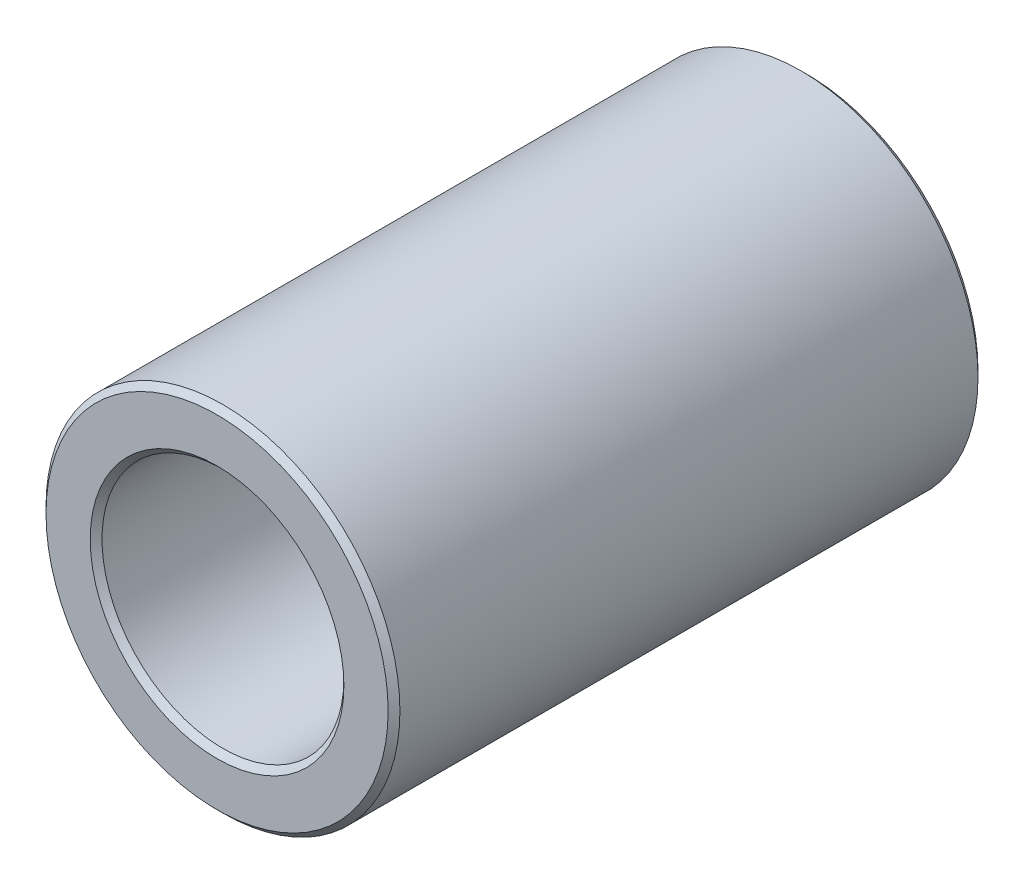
ISO-10303-21;
HEADER;
FILE_DESCRIPTION(('STEP AP214'),'2;1');
FILE_NAME('part.step','',(''),(''),'','','');
FILE_SCHEMA(('AUTOMOTIVE_DESIGN { 1 0 10303 214 1 1 1 1 }'));
ENDSEC;
DATA;
#1=APPLICATION_CONTEXT('core data for automotive mechanical design processes');
#2=APPLICATION_PROTOCOL_DEFINITION('international standard','automotive_design',2000,#1);
#3=PRODUCT_CONTEXT('',#1,'mechanical');
#4=PRODUCT('Part','Part','',(#3));
#5=PRODUCT_RELATED_PRODUCT_CATEGORY('part','',(#4));
#6=PRODUCT_DEFINITION_FORMATION('','',#4);
#7=PRODUCT_DEFINITION_CONTEXT('part definition',#1,'design');
#8=PRODUCT_DEFINITION('design','',#6,#7);
#9=PRODUCT_DEFINITION_SHAPE('','',#8);
#10=(LENGTH_UNIT() NAMED_UNIT(*) SI_UNIT(.MILLI.,.METRE.));
#11=(NAMED_UNIT(*) PLANE_ANGLE_UNIT() SI_UNIT($,.RADIAN.));
#12=(NAMED_UNIT(*) SI_UNIT($,.STERADIAN.) SOLID_ANGLE_UNIT());
#13=UNCERTAINTY_MEASURE_WITH_UNIT(LENGTH_MEASURE(1.E-05),#10,'distance_accuracy_value','');
#14=(GEOMETRIC_REPRESENTATION_CONTEXT(3) GLOBAL_UNCERTAINTY_ASSIGNED_CONTEXT((#13)) GLOBAL_UNIT_ASSIGNED_CONTEXT((#10,
#11,#12)) REPRESENTATION_CONTEXT('',''));
#15=CARTESIAN_POINT('',(0.,0.,0.));
#16=DIRECTION('',(0.,0.,1.));
#17=DIRECTION('',(1.,0.,0.));
#18=AXIS2_PLACEMENT_3D('',#15,#16,#17);
#19=CARTESIAN_POINT('',(0.,0.,10.));
#20=DIRECTION('',(0.,0.,1.));
#21=DIRECTION('',(1.,0.,0.));
#22=AXIS2_PLACEMENT_3D('',#19,#20,#21);
#23=PLANE('',#22);
#24=CARTESIAN_POINT('',(0.,0.,10.));
#25=DIRECTION('',(0.,0.,1.));
#26=DIRECTION('',(1.,0.,0.));
#27=AXIS2_PLACEMENT_3D('',#24,#25,#26);
#28=CIRCLE('',#27,4.30000000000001);
#29=CARTESIAN_POINT('',(4.30000000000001,0.,10.));
#30=VERTEX_POINT('',#29);
#31=EDGE_CURVE('E10',#30,#30,#28,.F.);
#32=ORIENTED_EDGE('',*,*,#31,.T.);
#33=EDGE_LOOP('',(#32));
#34=FACE_BOUND('',#33,.T.);
#35=CARTESIAN_POINT('',(0.,0.,10.));
#36=DIRECTION('',(0.,0.,1.));
#37=DIRECTION('',(1.,0.,0.));
#38=AXIS2_PLACEMENT_3D('',#35,#36,#37);
#39=CIRCLE('',#38,5.8);
#40=CARTESIAN_POINT('',(5.8,0.,10.));
#41=VERTEX_POINT('',#40);
#42=EDGE_CURVE('E45',#41,#41,#39,.T.);
#43=ORIENTED_EDGE('',*,*,#42,.T.);
#44=EDGE_LOOP('',(#43));
#45=FACE_BOUND('',#44,.T.);
#46=ADVANCED_FACE('F37',(#34,#45),#23,.T.);
#47=CARTESIAN_POINT('',(0.,0.,-10.));
#48=DIRECTION('',(0.,0.,1.));
#49=DIRECTION('',(1.,0.,0.));
#50=AXIS2_PLACEMENT_3D('',#47,#48,#49);
#51=PLANE('',#50);
#52=CARTESIAN_POINT('',(0.,0.,-10.));
#53=DIRECTION('',(0.,0.,1.));
#54=DIRECTION('',(1.,0.,0.));
#55=AXIS2_PLACEMENT_3D('',#52,#53,#54);
#56=CIRCLE('',#55,5.8);
#57=CARTESIAN_POINT('',(5.8,0.,-10.));
#58=VERTEX_POINT('',#57);
#59=EDGE_CURVE('E62',#58,#58,#56,.F.);
#60=ORIENTED_EDGE('',*,*,#59,.T.);
#61=EDGE_LOOP('',(#60));
#62=FACE_BOUND('',#61,.T.);
#63=CARTESIAN_POINT('',(0.,0.,-10.));
#64=DIRECTION('',(0.,0.,1.));
#65=DIRECTION('',(1.,0.,0.));
#66=AXIS2_PLACEMENT_3D('',#63,#64,#65);
#67=CIRCLE('',#66,4.3);
#68=CARTESIAN_POINT('',(4.3,0.,-10.));
#69=VERTEX_POINT('',#68);
#70=EDGE_CURVE('E66',#69,#69,#67,.T.);
#71=ORIENTED_EDGE('',*,*,#70,.T.);
#72=EDGE_LOOP('',(#71));
#73=FACE_BOUND('',#72,.T.);
#74=ADVANCED_FACE('F89',(#62,#73),#51,.F.);
#75=CARTESIAN_POINT('',(0.,0.,10.));
#76=DIRECTION('',(0.,0.,-1.));
#77=DIRECTION('',(-1.,0.,0.));
#78=AXIS2_PLACEMENT_3D('',#75,#76,#77);
#79=CYLINDRICAL_SURFACE('',#78,6.);
#80=CARTESIAN_POINT('',(0.,0.,-9.8));
#81=DIRECTION('',(0.,0.,1.));
#82=DIRECTION('',(1.,0.,0.));
#83=AXIS2_PLACEMENT_3D('',#80,#81,#82);
#84=CIRCLE('',#83,6.);
#85=CARTESIAN_POINT('',(6.,0.,-9.8));
#86=VERTEX_POINT('',#85);
#87=EDGE_CURVE('E69',#86,#86,#84,.T.);
#88=ORIENTED_EDGE('',*,*,#87,.T.);
#89=EDGE_LOOP('',(#88));
#90=FACE_BOUND('',#89,.T.);
#91=CARTESIAN_POINT('',(0.,0.,9.8));
#92=DIRECTION('',(0.,0.,1.));
#93=DIRECTION('',(1.,0.,0.));
#94=AXIS2_PLACEMENT_3D('',#91,#92,#93);
#95=CIRCLE('',#94,6.);
#96=CARTESIAN_POINT('',(6.,0.,9.8));
#97=VERTEX_POINT('',#96);
#98=EDGE_CURVE('E73',#97,#97,#95,.F.);
#99=ORIENTED_EDGE('',*,*,#98,.T.);
#100=EDGE_LOOP('',(#99));
#101=FACE_BOUND('',#100,.T.);
#102=ADVANCED_FACE('F78',(#90,#101),#79,.T.);
#103=CARTESIAN_POINT('',(0.,0.,10.));
#104=DIRECTION('',(0.,0.,-1.));
#105=DIRECTION('',(-1.,0.,0.));
#106=AXIS2_PLACEMENT_3D('',#103,#104,#105);
#107=CYLINDRICAL_SURFACE('',#106,4.1);
#108=CARTESIAN_POINT('',(0.,0.,-9.8));
#109=DIRECTION('',(0.,0.,1.));
#110=DIRECTION('',(1.,0.,0.));
#111=AXIS2_PLACEMENT_3D('',#108,#109,#110);
#112=CIRCLE('',#111,4.1);
#113=CARTESIAN_POINT('',(4.1,0.,-9.8));
#114=VERTEX_POINT('',#113);
#115=EDGE_CURVE('E51',#114,#114,#112,.F.);
#116=ORIENTED_EDGE('',*,*,#115,.T.);
#117=EDGE_LOOP('',(#116));
#118=FACE_BOUND('',#117,.T.);
#119=CARTESIAN_POINT('',(0.,0.,9.79999999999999));
#120=DIRECTION('',(0.,0.,1.));
#121=DIRECTION('',(1.,0.,0.));
#122=AXIS2_PLACEMENT_3D('',#119,#120,#121);
#123=CIRCLE('',#122,4.1);
#124=CARTESIAN_POINT('',(4.1,0.,9.79999999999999));
#125=VERTEX_POINT('',#124);
#126=EDGE_CURVE('E56',#125,#125,#123,.T.);
#127=ORIENTED_EDGE('',*,*,#126,.T.);
#128=EDGE_LOOP('',(#127));
#129=FACE_BOUND('',#128,.T.);
#130=ADVANCED_FACE('F97',(#118,#129),#107,.F.);
#131=CARTESIAN_POINT('',(0.,0.,-9.8));
#132=DIRECTION('',(0.,0.,1.));
#133=DIRECTION('',(1.,0.,0.));
#134=AXIS2_PLACEMENT_3D('',#131,#132,#133);
#135=CONICAL_SURFACE('',#134,6.,0.785398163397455);
#136=ORIENTED_EDGE('',*,*,#59,.F.);
#137=EDGE_LOOP('',(#136));
#138=FACE_BOUND('',#137,.T.);
#139=ORIENTED_EDGE('',*,*,#87,.F.);
#140=EDGE_LOOP('',(#139));
#141=FACE_BOUND('',#140,.T.);
#142=ADVANCED_FACE('F102',(#138,#141),#135,.T.);
#143=CARTESIAN_POINT('',(0.,0.,-10.));
#144=DIRECTION('',(0.,0.,-1.));
#145=DIRECTION('',(-1.,0.,0.));
#146=AXIS2_PLACEMENT_3D('',#143,#144,#145);
#147=CONICAL_SURFACE('',#146,4.3,0.785398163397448);
#148=ORIENTED_EDGE('',*,*,#115,.F.);
#149=EDGE_LOOP('',(#148));
#150=FACE_BOUND('',#149,.T.);
#151=ORIENTED_EDGE('',*,*,#70,.F.);
#152=EDGE_LOOP('',(#151));
#153=FACE_BOUND('',#152,.T.);
#154=ADVANCED_FACE('F86',(#150,#153),#147,.F.);
#155=CARTESIAN_POINT('',(0.,0.,9.79999999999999));
#156=DIRECTION('',(0.,0.,1.));
#157=DIRECTION('',(1.,0.,0.));
#158=AXIS2_PLACEMENT_3D('',#155,#156,#157);
#159=CONICAL_SURFACE('',#158,4.1,0.78539816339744);
#160=ORIENTED_EDGE('',*,*,#31,.F.);
#161=EDGE_LOOP('',(#160));
#162=FACE_BOUND('',#161,.T.);
#163=ORIENTED_EDGE('',*,*,#126,.F.);
#164=EDGE_LOOP('',(#163));
#165=FACE_BOUND('',#164,.T.);
#166=ADVANCED_FACE('F82',(#162,#165),#159,.F.);
#167=CARTESIAN_POINT('',(0.,0.,10.));
#168=DIRECTION('',(0.,0.,-1.));
#169=DIRECTION('',(-1.,0.,0.));
#170=AXIS2_PLACEMENT_3D('',#167,#168,#169);
#171=CONICAL_SURFACE('',#170,5.8,0.785398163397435);
#172=ORIENTED_EDGE('',*,*,#98,.F.);
#173=EDGE_LOOP('',(#172));
#174=FACE_BOUND('',#173,.T.);
#175=ORIENTED_EDGE('',*,*,#42,.F.);
#176=EDGE_LOOP('',(#175));
#177=FACE_BOUND('',#176,.T.);
#178=ADVANCED_FACE('F39',(#174,#177),#171,.T.);
#179=CLOSED_SHELL('',(#46,#74,#102,#130,#142,#154,#166,#178));
#180=MANIFOLD_SOLID_BREP('B2',#179);
#181=ADVANCED_BREP_SHAPE_REPRESENTATION('',(#18,#180),#14);
#182=SHAPE_DEFINITION_REPRESENTATION(#9,#181);
ENDSEC;
END-ISO-10303-21;
